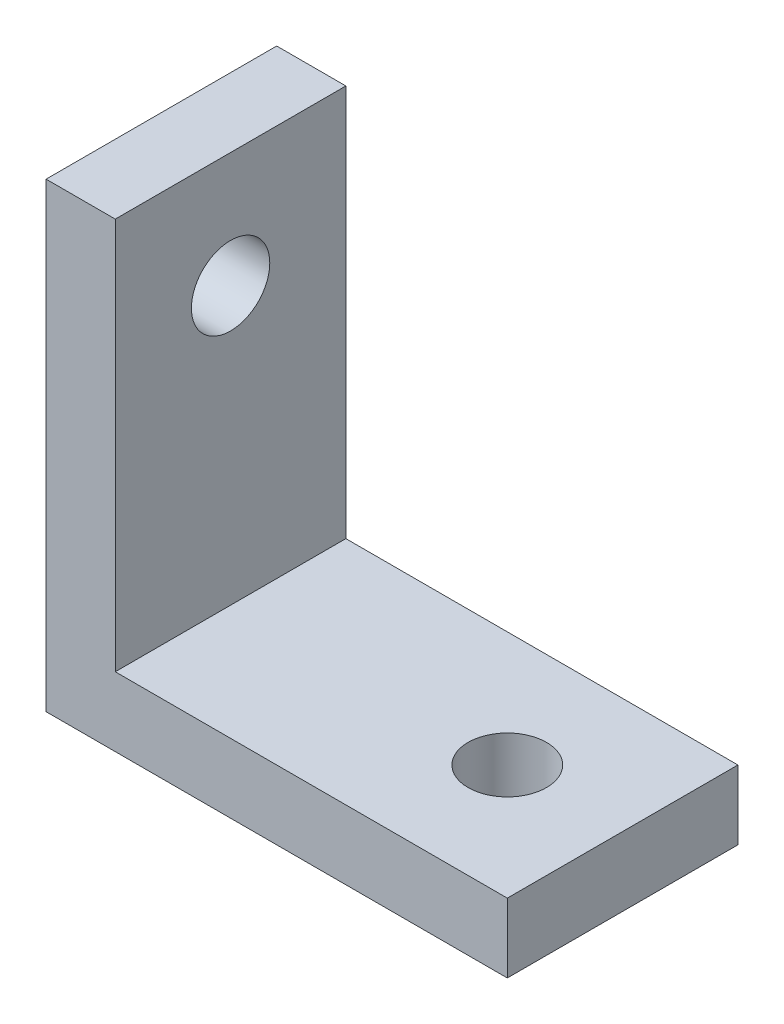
from build123d import *

# Parameters (mm, degrees)
SKETCH_1_W              = 20
SKETCH_1_H              = 20
EXTRUDE_1_DEPTH         = 10
SKETCH_2_W              = 17
SKETCH_2_H              = 17
CUT_EXTRUDE_1_DEPTH     = 10
HOLE_WIZARD_3_4_3_4_1_D = 3.4
HOLE_WIZARD_3_4_3_4_2_D = 3.4


with BuildPart() as part:
    # Sketch 1 → Extrude 1 (new body)
    with BuildSketch(Plane.XY):
        Rectangle(SKETCH_1_W, SKETCH_1_H)
    extrude(amount=EXTRUDE_1_DEPTH)

    # Sketch 2 → Cut-Extrude 1 (cut)
    with BuildSketch(Plane.XY.offset(10)):
        with Locations((1.5, 1.5)):
            Rectangle(SKETCH_2_W, SKETCH_2_H)
    extrude(amount=-CUT_EXTRUDE_1_DEPTH, mode=Mode.SUBTRACT)

    # Hole Wizard 3.4 _3.4_ _1 (through all)
    with Locations(Plane(origin=(-7, 0, 0), x_dir=(0, 0, -1), z_dir=(1, 0, 0))):
        with Locations((-5, 5)):
            Hole(HOLE_WIZARD_3_4_3_4_1_D / 2)

    # Hole Wizard 3.4 _3.4_ _2 (through all)
    with Locations(Plane(origin=(0, -7, 0), x_dir=(1, 0, 0), z_dir=(0, 1, 0))):
        with Locations((5, -5)):
            Hole(HOLE_WIZARD_3_4_3_4_2_D / 2)


solid = part.part
